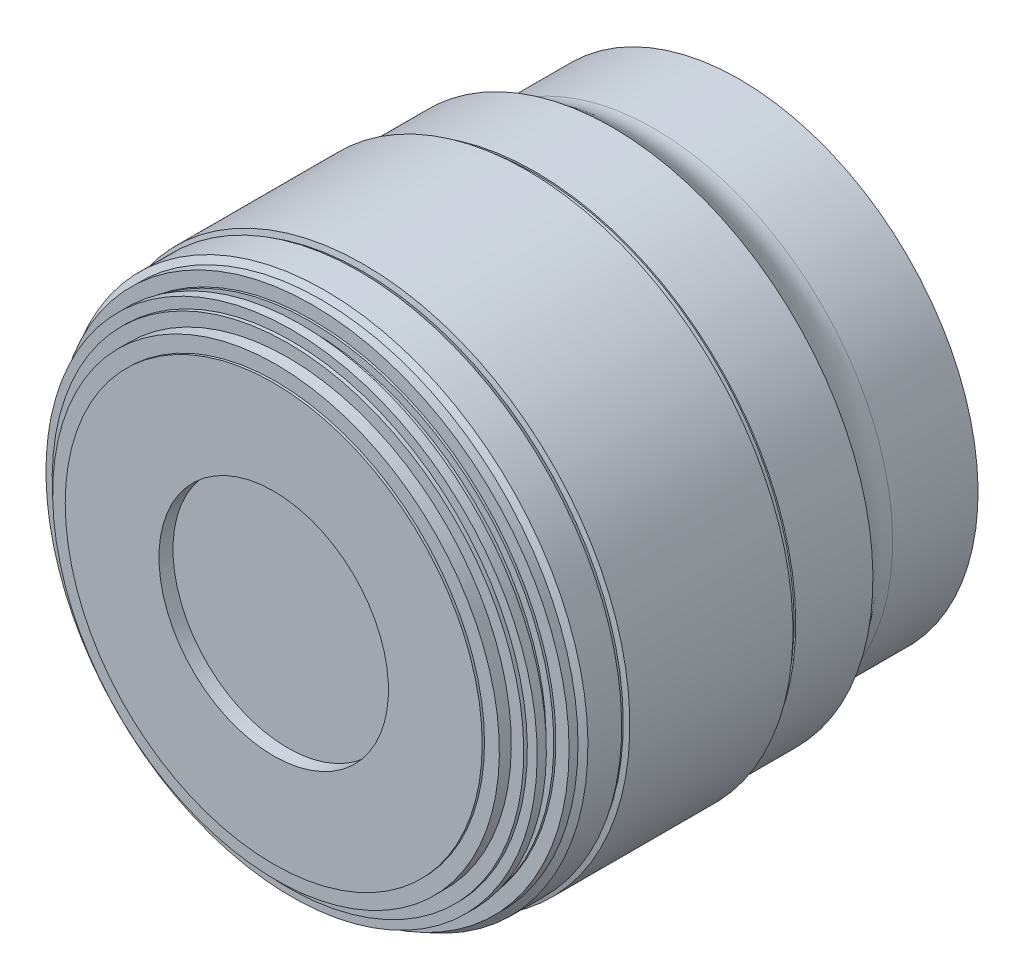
ISO-10303-21;
HEADER;
FILE_DESCRIPTION(('STEP AP214'),'2;1');
FILE_NAME('part.step','',(''),(''),'','','');
FILE_SCHEMA(('AUTOMOTIVE_DESIGN { 1 0 10303 214 1 1 1 1 }'));
ENDSEC;
DATA;
#1=APPLICATION_CONTEXT('core data for automotive mechanical design processes');
#2=APPLICATION_PROTOCOL_DEFINITION('international standard','automotive_design',2000,#1);
#3=PRODUCT_CONTEXT('',#1,'mechanical');
#4=PRODUCT('Part','Part','',(#3));
#5=PRODUCT_RELATED_PRODUCT_CATEGORY('part','',(#4));
#6=PRODUCT_DEFINITION_FORMATION('','',#4);
#7=PRODUCT_DEFINITION_CONTEXT('part definition',#1,'design');
#8=PRODUCT_DEFINITION('design','',#6,#7);
#9=PRODUCT_DEFINITION_SHAPE('','',#8);
#10=(LENGTH_UNIT() NAMED_UNIT(*) SI_UNIT(.MILLI.,.METRE.));
#11=(NAMED_UNIT(*) PLANE_ANGLE_UNIT() SI_UNIT($,.RADIAN.));
#12=(NAMED_UNIT(*) SI_UNIT($,.STERADIAN.) SOLID_ANGLE_UNIT());
#13=UNCERTAINTY_MEASURE_WITH_UNIT(LENGTH_MEASURE(1.E-05),#10,'distance_accuracy_value','');
#14=(GEOMETRIC_REPRESENTATION_CONTEXT(3) GLOBAL_UNCERTAINTY_ASSIGNED_CONTEXT((#13)) GLOBAL_UNIT_ASSIGNED_CONTEXT((#10,
#11,#12)) REPRESENTATION_CONTEXT('',''));
#15=CARTESIAN_POINT('',(0.,0.,0.));
#16=DIRECTION('',(0.,0.,1.));
#17=DIRECTION('',(1.,0.,0.));
#18=AXIS2_PLACEMENT_3D('',#15,#16,#17);
#19=CARTESIAN_POINT('',(0.,22.5666826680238,0.));
#20=DIRECTION('',(0.,0.,-1.));
#21=DIRECTION('',(0.,1.,0.));
#22=AXIS2_PLACEMENT_3D('',#19,#20,#21);
#23=PLANE('',#22);
#24=CARTESIAN_POINT('',(0.,0.,0.));
#25=DIRECTION('',(0.,0.,-1.));
#26=DIRECTION('',(0.,1.,0.));
#27=AXIS2_PLACEMENT_3D('',#24,#25,#26);
#28=CIRCLE('',#27,22.5666826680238);
#29=CARTESIAN_POINT('',(0.,22.5666826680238,0.));
#30=VERTEX_POINT('',#29);
#31=EDGE_CURVE('E12',#30,#30,#28,.T.);
#32=ORIENTED_EDGE('',*,*,#31,.T.);
#33=EDGE_LOOP('',(#32));
#34=FACE_BOUND('',#33,.T.);
#35=ADVANCED_FACE('F53',(#34),#23,.T.);
#36=CARTESIAN_POINT('',(0.,0.,0.));
#37=DIRECTION('',(0.,0.,-1.));
#38=DIRECTION('',(0.,1.,0.));
#39=AXIS2_PLACEMENT_3D('',#36,#37,#38);
#40=CYLINDRICAL_SURFACE('',#39,22.5666826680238);
#41=CARTESIAN_POINT('',(0.,0.,0.31721651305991));
#42=DIRECTION('',(0.,0.,-1.));
#43=DIRECTION('',(0.,1.,0.));
#44=AXIS2_PLACEMENT_3D('',#41,#42,#43);
#45=CIRCLE('',#44,22.5666826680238);
#46=CARTESIAN_POINT('',(0.,22.5666826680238,0.317216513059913));
#47=VERTEX_POINT('',#46);
#48=EDGE_CURVE('E60',#47,#47,#45,.T.);
#49=ORIENTED_EDGE('',*,*,#48,.T.);
#50=EDGE_LOOP('',(#49));
#51=FACE_BOUND('',#50,.T.);
#52=ORIENTED_EDGE('',*,*,#31,.F.);
#53=EDGE_LOOP('',(#52));
#54=FACE_BOUND('',#53,.T.);
#55=ADVANCED_FACE('F81',(#51,#54),#40,.T.);
#56=CARTESIAN_POINT('',(0.,22.5666826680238,0.317216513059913));
#57=DIRECTION('',(0.,0.,1.));
#58=DIRECTION('',(0.,-1.,0.));
#59=AXIS2_PLACEMENT_3D('',#56,#57,#58);
#60=PLANE('',#59);
#61=CARTESIAN_POINT('',(0.,0.,0.31721651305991));
#62=DIRECTION('',(0.,0.,-1.));
#63=DIRECTION('',(0.,1.,0.));
#64=AXIS2_PLACEMENT_3D('',#61,#62,#63);
#65=CIRCLE('',#64,22.3985393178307);
#66=CARTESIAN_POINT('',(0.,22.3985393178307,0.317216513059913));
#67=VERTEX_POINT('',#66);
#68=EDGE_CURVE('E231',#67,#67,#65,.T.);
#69=ORIENTED_EDGE('',*,*,#68,.T.);
#70=EDGE_LOOP('',(#69));
#71=FACE_BOUND('',#70,.T.);
#72=ORIENTED_EDGE('',*,*,#48,.F.);
#73=EDGE_LOOP('',(#72));
#74=FACE_BOUND('',#73,.T.);
#75=ADVANCED_FACE('F86',(#71,#74),#60,.T.);
#76=CARTESIAN_POINT('',(0.,0.,0.));
#77=DIRECTION('',(0.,0.,-1.));
#78=DIRECTION('',(0.,1.,0.));
#79=AXIS2_PLACEMENT_3D('',#76,#77,#78);
#80=CYLINDRICAL_SURFACE('',#79,22.3985393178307);
#81=CARTESIAN_POINT('',(0.,0.,1.66055023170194));
#82=DIRECTION('',(0.,0.,-1.));
#83=DIRECTION('',(0.,1.,0.));
#84=AXIS2_PLACEMENT_3D('',#81,#82,#83);
#85=CIRCLE('',#84,22.3985393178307);
#86=CARTESIAN_POINT('',(0.,22.3985393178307,1.66055023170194));
#87=VERTEX_POINT('',#86);
#88=EDGE_CURVE('E228',#87,#87,#85,.T.);
#89=ORIENTED_EDGE('',*,*,#88,.T.);
#90=EDGE_LOOP('',(#89));
#91=FACE_BOUND('',#90,.T.);
#92=ORIENTED_EDGE('',*,*,#68,.F.);
#93=EDGE_LOOP('',(#92));
#94=FACE_BOUND('',#93,.T.);
#95=ADVANCED_FACE('F93',(#91,#94),#80,.T.);
#96=CARTESIAN_POINT('',(0.,22.3985393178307,1.66055023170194));
#97=DIRECTION('',(0.,0.,-1.));
#98=DIRECTION('',(0.,1.,0.));
#99=AXIS2_PLACEMENT_3D('',#96,#97,#98);
#100=PLANE('',#99);
#101=CARTESIAN_POINT('',(0.,0.,1.66055023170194));
#102=DIRECTION('',(0.,0.,-1.));
#103=DIRECTION('',(0.,1.,0.));
#104=AXIS2_PLACEMENT_3D('',#101,#102,#103);
#105=CIRCLE('',#104,23.9827601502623);
#106=CARTESIAN_POINT('',(0.,23.9827601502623,1.66055023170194));
#107=VERTEX_POINT('',#106);
#108=EDGE_CURVE('E225',#107,#107,#105,.T.);
#109=ORIENTED_EDGE('',*,*,#108,.T.);
#110=EDGE_LOOP('',(#109));
#111=FACE_BOUND('',#110,.T.);
#112=ORIENTED_EDGE('',*,*,#88,.F.);
#113=EDGE_LOOP('',(#112));
#114=FACE_BOUND('',#113,.T.);
#115=ADVANCED_FACE('F100',(#111,#114),#100,.T.);
#116=CARTESIAN_POINT('',(0.,0.,0.));
#117=DIRECTION('',(0.,0.,-1.));
#118=DIRECTION('',(0.,1.,0.));
#119=AXIS2_PLACEMENT_3D('',#116,#117,#118);
#120=CYLINDRICAL_SURFACE('',#119,23.9827601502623);
#121=CARTESIAN_POINT('',(0.,0.,2.78672208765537));
#122=DIRECTION('',(0.,0.,-1.));
#123=DIRECTION('',(0.,1.,0.));
#124=AXIS2_PLACEMENT_3D('',#121,#122,#123);
#125=CIRCLE('',#124,23.9827601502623);
#126=CARTESIAN_POINT('',(0.,23.9827601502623,2.78672208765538));
#127=VERTEX_POINT('',#126);
#128=EDGE_CURVE('E222',#127,#127,#125,.T.);
#129=ORIENTED_EDGE('',*,*,#128,.T.);
#130=EDGE_LOOP('',(#129));
#131=FACE_BOUND('',#130,.T.);
#132=ORIENTED_EDGE('',*,*,#108,.F.);
#133=EDGE_LOOP('',(#132));
#134=FACE_BOUND('',#133,.T.);
#135=ADVANCED_FACE('F104',(#131,#134),#120,.T.);
#136=CARTESIAN_POINT('',(0.,23.9827601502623,2.78672208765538));
#137=DIRECTION('',(0.,0.,-1.));
#138=DIRECTION('',(0.,1.,0.));
#139=AXIS2_PLACEMENT_3D('',#136,#137,#138);
#140=PLANE('',#139);
#141=CARTESIAN_POINT('',(0.,0.,2.78672208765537));
#142=DIRECTION('',(0.,0.,-1.));
#143=DIRECTION('',(0.,1.,0.));
#144=AXIS2_PLACEMENT_3D('',#141,#142,#143);
#145=CIRCLE('',#144,29.2701819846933);
#146=CARTESIAN_POINT('',(0.,29.2701819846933,2.78672208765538));
#147=VERTEX_POINT('',#146);
#148=EDGE_CURVE('E219',#147,#147,#145,.T.);
#149=ORIENTED_EDGE('',*,*,#148,.T.);
#150=EDGE_LOOP('',(#149));
#151=FACE_BOUND('',#150,.T.);
#152=ORIENTED_EDGE('',*,*,#128,.F.);
#153=EDGE_LOOP('',(#152));
#154=FACE_BOUND('',#153,.T.);
#155=ADVANCED_FACE('F108',(#151,#154),#140,.T.);
#156=CARTESIAN_POINT('',(0.,0.,0.));
#157=DIRECTION('',(0.,0.,-1.));
#158=DIRECTION('',(0.,1.,0.));
#159=AXIS2_PLACEMENT_3D('',#156,#157,#158);
#160=CYLINDRICAL_SURFACE('',#159,29.2701819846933);
#161=CARTESIAN_POINT('',(0.,0.,3.06095479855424));
#162=DIRECTION('',(0.,0.,-1.));
#163=DIRECTION('',(0.,1.,0.));
#164=AXIS2_PLACEMENT_3D('',#161,#162,#163);
#165=CIRCLE('',#164,29.2701819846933);
#166=CARTESIAN_POINT('',(0.,29.2701819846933,3.06095479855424));
#167=VERTEX_POINT('',#166);
#168=EDGE_CURVE('E216',#167,#167,#165,.T.);
#169=ORIENTED_EDGE('',*,*,#168,.T.);
#170=EDGE_LOOP('',(#169));
#171=FACE_BOUND('',#170,.T.);
#172=ORIENTED_EDGE('',*,*,#148,.F.);
#173=EDGE_LOOP('',(#172));
#174=FACE_BOUND('',#173,.T.);
#175=ADVANCED_FACE('F112',(#171,#174),#160,.T.);
#176=CARTESIAN_POINT('',(0.,29.2701819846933,3.06095479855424));
#177=DIRECTION('',(0.,0.,-1.));
#178=DIRECTION('',(0.,1.,0.));
#179=AXIS2_PLACEMENT_3D('',#176,#177,#178);
#180=PLANE('',#179);
#181=CARTESIAN_POINT('',(0.,0.,3.06095479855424));
#182=DIRECTION('',(0.,0.,-1.));
#183=DIRECTION('',(0.,1.,0.));
#184=AXIS2_PLACEMENT_3D('',#181,#182,#183);
#185=CIRCLE('',#184,30.7);
#186=CARTESIAN_POINT('',(0.,30.7,3.06095479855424));
#187=VERTEX_POINT('',#186);
#188=EDGE_CURVE('E213',#187,#187,#185,.T.);
#189=ORIENTED_EDGE('',*,*,#188,.T.);
#190=EDGE_LOOP('',(#189));
#191=FACE_BOUND('',#190,.T.);
#192=ORIENTED_EDGE('',*,*,#168,.F.);
#193=EDGE_LOOP('',(#192));
#194=FACE_BOUND('',#193,.T.);
#195=ADVANCED_FACE('F116',(#191,#194),#180,.T.);
#196=CARTESIAN_POINT('',(0.,0.,0.));
#197=DIRECTION('',(0.,0.,-1.));
#198=DIRECTION('',(0.,1.,0.));
#199=AXIS2_PLACEMENT_3D('',#196,#197,#198);
#200=CYLINDRICAL_SURFACE('',#199,30.7);
#201=CARTESIAN_POINT('',(0.,0.,14.0609547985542));
#202=DIRECTION('',(0.,0.,-1.));
#203=DIRECTION('',(0.,1.,0.));
#204=AXIS2_PLACEMENT_3D('',#201,#202,#203);
#205=CIRCLE('',#204,30.7);
#206=CARTESIAN_POINT('',(0.,30.7,14.0609547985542));
#207=VERTEX_POINT('',#206);
#208=EDGE_CURVE('E210',#207,#207,#205,.T.);
#209=ORIENTED_EDGE('',*,*,#208,.T.);
#210=EDGE_LOOP('',(#209));
#211=FACE_BOUND('',#210,.T.);
#212=ORIENTED_EDGE('',*,*,#188,.F.);
#213=EDGE_LOOP('',(#212));
#214=FACE_BOUND('',#213,.T.);
#215=ADVANCED_FACE('F120',(#211,#214),#200,.T.);
#216=CARTESIAN_POINT('',(0.,30.7,14.0609547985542));
#217=CARTESIAN_POINT('',(0.,30.7,16.4988069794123));
#218=CARTESIAN_POINT('',(0.,32.3073486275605,17.7825013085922));
#219=CARTESIAN_POINT('',(0.,33.55,19.4478462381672));
#220=B_SPLINE_CURVE_WITH_KNOTS('',3,(#216,#217,#218,#219),.UNSPECIFIED.,.F.,.F.,(4,4),(0.,1.),.UNSPECIFIED.);
#221=CARTESIAN_POINT('',(0.,0.,0.));
#222=DIRECTION('',(0.,0.,-1.));
#223=AXIS1_PLACEMENT('',#221,#222);
#224=SURFACE_OF_REVOLUTION('',#220,#223);
#225=CARTESIAN_POINT('',(0.,0.,19.4478462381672));
#226=DIRECTION('',(0.,0.,-1.));
#227=DIRECTION('',(0.,1.,0.));
#228=AXIS2_PLACEMENT_3D('',#225,#226,#227);
#229=CIRCLE('',#228,33.55);
#230=CARTESIAN_POINT('',(0.,33.55,19.4478462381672));
#231=VERTEX_POINT('',#230);
#232=EDGE_CURVE('E207',#231,#231,#229,.T.);
#233=ORIENTED_EDGE('',*,*,#232,.T.);
#234=EDGE_LOOP('',(#233));
#235=FACE_BOUND('',#234,.T.);
#236=ORIENTED_EDGE('',*,*,#208,.F.);
#237=EDGE_LOOP('',(#236));
#238=FACE_BOUND('',#237,.T.);
#239=ADVANCED_FACE('F124',(#235,#238),#224,.F.);
#240=CARTESIAN_POINT('',(0.,0.,0.));
#241=DIRECTION('',(0.,0.,-1.));
#242=DIRECTION('',(0.,1.,0.));
#243=AXIS2_PLACEMENT_3D('',#240,#241,#242);
#244=CYLINDRICAL_SURFACE('',#243,33.55);
#245=CARTESIAN_POINT('',(0.,0.,29.3850400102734));
#246=DIRECTION('',(0.,0.,-1.));
#247=DIRECTION('',(0.,1.,0.));
#248=AXIS2_PLACEMENT_3D('',#245,#246,#247);
#249=CIRCLE('',#248,33.55);
#250=CARTESIAN_POINT('',(0.,33.55,29.3850400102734));
#251=VERTEX_POINT('',#250);
#252=EDGE_CURVE('E204',#251,#251,#249,.T.);
#253=ORIENTED_EDGE('',*,*,#252,.T.);
#254=EDGE_LOOP('',(#253));
#255=FACE_BOUND('',#254,.T.);
#256=ORIENTED_EDGE('',*,*,#232,.F.);
#257=EDGE_LOOP('',(#256));
#258=FACE_BOUND('',#257,.T.);
#259=ADVANCED_FACE('F129',(#255,#258),#244,.T.);
#260=CARTESIAN_POINT('',(0.,33.55,29.3850400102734));
#261=DIRECTION('',(0.,0.,1.));
#262=DIRECTION('',(0.,-1.,0.));
#263=AXIS2_PLACEMENT_3D('',#260,#261,#262);
#264=PLANE('',#263);
#265=CARTESIAN_POINT('',(0.,0.,29.3850400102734));
#266=DIRECTION('',(0.,0.,-1.));
#267=DIRECTION('',(0.,1.,0.));
#268=AXIS2_PLACEMENT_3D('',#265,#266,#267);
#269=CIRCLE('',#268,33.3422035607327);
#270=CARTESIAN_POINT('',(0.,33.3422035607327,29.3850400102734));
#271=VERTEX_POINT('',#270);
#272=EDGE_CURVE('E201',#271,#271,#269,.T.);
#273=ORIENTED_EDGE('',*,*,#272,.T.);
#274=EDGE_LOOP('',(#273));
#275=FACE_BOUND('',#274,.T.);
#276=ORIENTED_EDGE('',*,*,#252,.F.);
#277=EDGE_LOOP('',(#276));
#278=FACE_BOUND('',#277,.T.);
#279=ADVANCED_FACE('F255',(#275,#278),#264,.T.);
#280=CARTESIAN_POINT('',(0.,0.,0.));
#281=DIRECTION('',(0.,0.,-1.));
#282=DIRECTION('',(0.,1.,0.));
#283=AXIS2_PLACEMENT_3D('',#280,#281,#282);
#284=CYLINDRICAL_SURFACE('',#283,33.3422035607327);
#285=CARTESIAN_POINT('',(0.,0.,29.857058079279));
#286=DIRECTION('',(0.,0.,-1.));
#287=DIRECTION('',(0.,1.,0.));
#288=AXIS2_PLACEMENT_3D('',#285,#286,#287);
#289=CIRCLE('',#288,33.3422035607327);
#290=CARTESIAN_POINT('',(0.,33.3422035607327,29.857058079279));
#291=VERTEX_POINT('',#290);
#292=EDGE_CURVE('E198',#291,#291,#289,.T.);
#293=ORIENTED_EDGE('',*,*,#292,.T.);
#294=EDGE_LOOP('',(#293));
#295=FACE_BOUND('',#294,.T.);
#296=ORIENTED_EDGE('',*,*,#272,.F.);
#297=EDGE_LOOP('',(#296));
#298=FACE_BOUND('',#297,.T.);
#299=ADVANCED_FACE('F260',(#295,#298),#284,.T.);
#300=CARTESIAN_POINT('',(0.,0.,29.857058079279));
#301=DIRECTION('',(0.,0.,1.));
#302=DIRECTION('',(0.,-1.,0.));
#303=AXIS2_PLACEMENT_3D('',#300,#301,#302);
#304=CONICAL_SURFACE('',#303,33.3422035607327,0.993863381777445);
#305=CARTESIAN_POINT('',(0.,0.,30.4478462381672));
#306=DIRECTION('',(0.,0.,-1.));
#307=DIRECTION('',(0.,1.,0.));
#308=AXIS2_PLACEMENT_3D('',#305,#306,#307);
#309=CIRCLE('',#308,34.25);
#310=CARTESIAN_POINT('',(0.,34.25,30.4478462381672));
#311=VERTEX_POINT('',#310);
#312=EDGE_CURVE('E195',#311,#311,#309,.T.);
#313=ORIENTED_EDGE('',*,*,#312,.T.);
#314=EDGE_LOOP('',(#313));
#315=FACE_BOUND('',#314,.T.);
#316=ORIENTED_EDGE('',*,*,#292,.F.);
#317=EDGE_LOOP('',(#316));
#318=FACE_BOUND('',#317,.T.);
#319=ADVANCED_FACE('F267',(#315,#318),#304,.T.);
#320=CARTESIAN_POINT('',(0.,0.,0.));
#321=DIRECTION('',(0.,0.,-1.));
#322=DIRECTION('',(0.,1.,0.));
#323=AXIS2_PLACEMENT_3D('',#320,#321,#322);
#324=CYLINDRICAL_SURFACE('',#323,34.25);
#325=CARTESIAN_POINT('',(0.,0.,51.4478462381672));
#326=DIRECTION('',(0.,0.,-1.));
#327=DIRECTION('',(0.,1.,0.));
#328=AXIS2_PLACEMENT_3D('',#325,#326,#327);
#329=CIRCLE('',#328,34.25);
#330=CARTESIAN_POINT('',(0.,34.25,51.4478462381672));
#331=VERTEX_POINT('',#330);
#332=EDGE_CURVE('E192',#331,#331,#329,.T.);
#333=ORIENTED_EDGE('',*,*,#332,.T.);
#334=EDGE_LOOP('',(#333));
#335=FACE_BOUND('',#334,.T.);
#336=ORIENTED_EDGE('',*,*,#312,.F.);
#337=EDGE_LOOP('',(#336));
#338=FACE_BOUND('',#337,.T.);
#339=ADVANCED_FACE('F273',(#335,#338),#324,.T.);
#340=CARTESIAN_POINT('',(0.,0.,51.4478462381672));
#341=DIRECTION('',(0.,0.,-1.));
#342=DIRECTION('',(0.,1.,0.));
#343=AXIS2_PLACEMENT_3D('',#340,#341,#342);
#344=CONICAL_SURFACE('',#343,34.25,1.357788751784);
#345=CARTESIAN_POINT('',(0.,0.,51.5992483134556));
#346=DIRECTION('',(0.,0.,-1.));
#347=DIRECTION('',(0.,1.,0.));
#348=AXIS2_PLACEMENT_3D('',#345,#346,#347);
#349=CIRCLE('',#348,33.55);
#350=CARTESIAN_POINT('',(0.,33.55,51.5992483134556));
#351=VERTEX_POINT('',#350);
#352=EDGE_CURVE('E189',#351,#351,#349,.T.);
#353=ORIENTED_EDGE('',*,*,#352,.T.);
#354=EDGE_LOOP('',(#353));
#355=FACE_BOUND('',#354,.T.);
#356=ORIENTED_EDGE('',*,*,#332,.F.);
#357=EDGE_LOOP('',(#356));
#358=FACE_BOUND('',#357,.T.);
#359=ADVANCED_FACE('F277',(#355,#358),#344,.T.);
#360=CARTESIAN_POINT('',(0.,0.,51.5992483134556));
#361=DIRECTION('',(0.,0.,1.));
#362=DIRECTION('',(0.,-1.,0.));
#363=AXIS2_PLACEMENT_3D('',#360,#361,#362);
#364=CONICAL_SURFACE('',#363,33.55,0.537902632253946);
#365=CARTESIAN_POINT('',(0.,0.,52.1021127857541));
#366=DIRECTION('',(0.,0.,-1.));
#367=DIRECTION('',(0.,1.,0.));
#368=AXIS2_PLACEMENT_3D('',#365,#366,#367);
#369=CIRCLE('',#368,33.85);
#370=CARTESIAN_POINT('',(0.,33.85,52.1021127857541));
#371=VERTEX_POINT('',#370);
#372=EDGE_CURVE('E186',#371,#371,#369,.T.);
#373=ORIENTED_EDGE('',*,*,#372,.T.);
#374=EDGE_LOOP('',(#373));
#375=FACE_BOUND('',#374,.T.);
#376=ORIENTED_EDGE('',*,*,#352,.F.);
#377=EDGE_LOOP('',(#376));
#378=FACE_BOUND('',#377,.T.);
#379=ADVANCED_FACE('F281',(#375,#378),#364,.T.);
#380=CARTESIAN_POINT('',(0.,0.,0.));
#381=DIRECTION('',(0.,0.,-1.));
#382=DIRECTION('',(0.,1.,0.));
#383=AXIS2_PLACEMENT_3D('',#380,#381,#382);
#384=CYLINDRICAL_SURFACE('',#383,33.85);
#385=CARTESIAN_POINT('',(0.,0.,56.4478462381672));
#386=DIRECTION('',(0.,0.,-1.));
#387=DIRECTION('',(0.,1.,0.));
#388=AXIS2_PLACEMENT_3D('',#385,#386,#387);
#389=CIRCLE('',#388,33.85);
#390=CARTESIAN_POINT('',(0.,33.85,56.4478462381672));
#391=VERTEX_POINT('',#390);
#392=EDGE_CURVE('E183',#391,#391,#389,.T.);
#393=ORIENTED_EDGE('',*,*,#392,.T.);
#394=EDGE_LOOP('',(#393));
#395=FACE_BOUND('',#394,.T.);
#396=ORIENTED_EDGE('',*,*,#372,.F.);
#397=EDGE_LOOP('',(#396));
#398=FACE_BOUND('',#397,.T.);
#399=ADVANCED_FACE('F285',(#395,#398),#384,.T.);
#400=CARTESIAN_POINT('',(0.,0.,56.4478462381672));
#401=DIRECTION('',(0.,0.,-1.));
#402=DIRECTION('',(0.,1.,0.));
#403=AXIS2_PLACEMENT_3D('',#400,#401,#402);
#404=CONICAL_SURFACE('',#403,33.85,1.03289369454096);
#405=CARTESIAN_POINT('',(0.,0.,56.9247464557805));
#406=DIRECTION('',(0.,0.,-1.));
#407=DIRECTION('',(0.,1.,0.));
#408=AXIS2_PLACEMENT_3D('',#405,#406,#407);
#409=CIRCLE('',#408,33.0506127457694);
#410=CARTESIAN_POINT('',(0.,33.0506127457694,56.9247464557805));
#411=VERTEX_POINT('',#410);
#412=EDGE_CURVE('E180',#411,#411,#409,.T.);
#413=ORIENTED_EDGE('',*,*,#412,.T.);
#414=EDGE_LOOP('',(#413));
#415=FACE_BOUND('',#414,.T.);
#416=ORIENTED_EDGE('',*,*,#392,.F.);
#417=EDGE_LOOP('',(#416));
#418=FACE_BOUND('',#417,.T.);
#419=ADVANCED_FACE('F289',(#415,#418),#404,.T.);
#420=CARTESIAN_POINT('',(0.,0.,0.));
#421=DIRECTION('',(0.,0.,-1.));
#422=DIRECTION('',(0.,1.,0.));
#423=AXIS2_PLACEMENT_3D('',#420,#421,#422);
#424=CYLINDRICAL_SURFACE('',#423,33.0506127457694);
#425=CARTESIAN_POINT('',(0.,0.,58.0757176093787));
#426=DIRECTION('',(0.,0.,-1.));
#427=DIRECTION('',(0.,1.,0.));
#428=AXIS2_PLACEMENT_3D('',#425,#426,#427);
#429=CIRCLE('',#428,33.0506127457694);
#430=CARTESIAN_POINT('',(0.,33.0506127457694,58.0757176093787));
#431=VERTEX_POINT('',#430);
#432=EDGE_CURVE('E177',#431,#431,#429,.T.);
#433=ORIENTED_EDGE('',*,*,#432,.T.);
#434=EDGE_LOOP('',(#433));
#435=FACE_BOUND('',#434,.T.);
#436=ORIENTED_EDGE('',*,*,#412,.F.);
#437=EDGE_LOOP('',(#436));
#438=FACE_BOUND('',#437,.T.);
#439=ADVANCED_FACE('F293',(#435,#438),#424,.T.);
#440=CARTESIAN_POINT('',(0.,33.0506127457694,58.0757176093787));
#441=DIRECTION('',(0.,0.,1.));
#442=DIRECTION('',(0.,-1.,0.));
#443=AXIS2_PLACEMENT_3D('',#440,#441,#442);
#444=PLANE('',#443);
#445=CARTESIAN_POINT('',(0.,0.,58.0757176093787));
#446=DIRECTION('',(0.,0.,-1.));
#447=DIRECTION('',(0.,1.,0.));
#448=AXIS2_PLACEMENT_3D('',#445,#446,#447);
#449=CIRCLE('',#448,31.3540227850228);
#450=CARTESIAN_POINT('',(0.,31.3540227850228,58.0757176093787));
#451=VERTEX_POINT('',#450);
#452=EDGE_CURVE('E174',#451,#451,#449,.T.);
#453=ORIENTED_EDGE('',*,*,#452,.T.);
#454=EDGE_LOOP('',(#453));
#455=FACE_BOUND('',#454,.T.);
#456=ORIENTED_EDGE('',*,*,#432,.F.);
#457=EDGE_LOOP('',(#456));
#458=FACE_BOUND('',#457,.T.);
#459=ADVANCED_FACE('F297',(#455,#458),#444,.T.);
#460=CARTESIAN_POINT('',(0.,0.,0.));
#461=DIRECTION('',(0.,0.,-1.));
#462=DIRECTION('',(0.,1.,0.));
#463=AXIS2_PLACEMENT_3D('',#460,#461,#462);
#464=CYLINDRICAL_SURFACE('',#463,31.3540227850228);
#465=CARTESIAN_POINT('',(0.,0.,58.3510421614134));
#466=DIRECTION('',(0.,0.,-1.));
#467=DIRECTION('',(0.,1.,0.));
#468=AXIS2_PLACEMENT_3D('',#465,#466,#467);
#469=CIRCLE('',#468,31.3540227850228);
#470=CARTESIAN_POINT('',(0.,31.3540227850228,58.3510421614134));
#471=VERTEX_POINT('',#470);
#472=EDGE_CURVE('E171',#471,#471,#469,.T.);
#473=ORIENTED_EDGE('',*,*,#472,.T.);
#474=EDGE_LOOP('',(#473));
#475=FACE_BOUND('',#474,.T.);
#476=ORIENTED_EDGE('',*,*,#452,.F.);
#477=EDGE_LOOP('',(#476));
#478=FACE_BOUND('',#477,.T.);
#479=ADVANCED_FACE('F301',(#475,#478),#464,.T.);
#480=CARTESIAN_POINT('',(0.,31.3540227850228,58.3510421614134));
#481=DIRECTION('',(0.,0.,1.));
#482=DIRECTION('',(0.,-1.,0.));
#483=AXIS2_PLACEMENT_3D('',#480,#481,#482);
#484=PLANE('',#483);
#485=CARTESIAN_POINT('',(0.,0.,58.3510421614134));
#486=DIRECTION('',(0.,0.,-1.));
#487=DIRECTION('',(0.,1.,0.));
#488=AXIS2_PLACEMENT_3D('',#485,#486,#487);
#489=CIRCLE('',#488,30.3637042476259);
#490=CARTESIAN_POINT('',(0.,30.3637042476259,58.3510421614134));
#491=VERTEX_POINT('',#490);
#492=EDGE_CURVE('E168',#491,#491,#489,.T.);
#493=ORIENTED_EDGE('',*,*,#492,.T.);
#494=EDGE_LOOP('',(#493));
#495=FACE_BOUND('',#494,.T.);
#496=ORIENTED_EDGE('',*,*,#472,.F.);
#497=EDGE_LOOP('',(#496));
#498=FACE_BOUND('',#497,.T.);
#499=ADVANCED_FACE('F305',(#495,#498),#484,.T.);
#500=CARTESIAN_POINT('',(0.,0.,0.));
#501=DIRECTION('',(0.,0.,-1.));
#502=DIRECTION('',(0.,1.,0.));
#503=AXIS2_PLACEMENT_3D('',#500,#501,#502);
#504=CYLINDRICAL_SURFACE('',#503,30.3637042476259);
#505=CARTESIAN_POINT('',(0.,0.,59.5751926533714));
#506=DIRECTION('',(0.,0.,-1.));
#507=DIRECTION('',(0.,1.,0.));
#508=AXIS2_PLACEMENT_3D('',#505,#506,#507);
#509=CIRCLE('',#508,30.3637042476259);
#510=CARTESIAN_POINT('',(0.,30.3637042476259,59.5751926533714));
#511=VERTEX_POINT('',#510);
#512=EDGE_CURVE('E165',#511,#511,#509,.T.);
#513=ORIENTED_EDGE('',*,*,#512,.T.);
#514=EDGE_LOOP('',(#513));
#515=FACE_BOUND('',#514,.T.);
#516=ORIENTED_EDGE('',*,*,#492,.F.);
#517=EDGE_LOOP('',(#516));
#518=FACE_BOUND('',#517,.T.);
#519=ADVANCED_FACE('F309',(#515,#518),#504,.T.);
#520=CARTESIAN_POINT('',(0.,30.3637042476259,59.5751926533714));
#521=DIRECTION('',(0.,0.,-1.));
#522=DIRECTION('',(0.,1.,0.));
#523=AXIS2_PLACEMENT_3D('',#520,#521,#522);
#524=PLANE('',#523);
#525=CARTESIAN_POINT('',(0.,0.,59.5751926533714));
#526=DIRECTION('',(0.,0.,-1.));
#527=DIRECTION('',(0.,1.,0.));
#528=AXIS2_PLACEMENT_3D('',#525,#526,#527);
#529=CIRCLE('',#528,31.6286537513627);
#530=CARTESIAN_POINT('',(0.,31.6286537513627,59.5751926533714));
#531=VERTEX_POINT('',#530);
#532=EDGE_CURVE('E162',#531,#531,#529,.T.);
#533=ORIENTED_EDGE('',*,*,#532,.T.);
#534=EDGE_LOOP('',(#533));
#535=FACE_BOUND('',#534,.T.);
#536=ORIENTED_EDGE('',*,*,#512,.F.);
#537=EDGE_LOOP('',(#536));
#538=FACE_BOUND('',#537,.T.);
#539=ADVANCED_FACE('F313',(#535,#538),#524,.T.);
#540=CARTESIAN_POINT('',(0.,0.,0.));
#541=DIRECTION('',(0.,0.,-1.));
#542=DIRECTION('',(0.,1.,0.));
#543=AXIS2_PLACEMENT_3D('',#540,#541,#542);
#544=CYLINDRICAL_SURFACE('',#543,31.6286537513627);
#545=CARTESIAN_POINT('',(0.,0.,60.7593114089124));
#546=DIRECTION('',(0.,0.,-1.));
#547=DIRECTION('',(0.,1.,0.));
#548=AXIS2_PLACEMENT_3D('',#545,#546,#547);
#549=CIRCLE('',#548,31.6286537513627);
#550=CARTESIAN_POINT('',(0.,31.6286537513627,60.7593114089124));
#551=VERTEX_POINT('',#550);
#552=EDGE_CURVE('E159',#551,#551,#549,.T.);
#553=ORIENTED_EDGE('',*,*,#552,.T.);
#554=EDGE_LOOP('',(#553));
#555=FACE_BOUND('',#554,.T.);
#556=ORIENTED_EDGE('',*,*,#532,.F.);
#557=EDGE_LOOP('',(#556));
#558=FACE_BOUND('',#557,.T.);
#559=ADVANCED_FACE('F317',(#555,#558),#544,.T.);
#560=CARTESIAN_POINT('',(0.,31.6286537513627,60.7593114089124));
#561=DIRECTION('',(0.,0.,1.));
#562=DIRECTION('',(0.,-1.,0.));
#563=AXIS2_PLACEMENT_3D('',#560,#561,#562);
#564=PLANE('',#563);
#565=CARTESIAN_POINT('',(0.,0.,60.7593114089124));
#566=DIRECTION('',(0.,0.,-1.));
#567=DIRECTION('',(0.,1.,0.));
#568=AXIS2_PLACEMENT_3D('',#565,#566,#567);
#569=CIRCLE('',#568,30.3637042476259);
#570=CARTESIAN_POINT('',(0.,30.3637042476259,60.7593114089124));
#571=VERTEX_POINT('',#570);
#572=EDGE_CURVE('E156',#571,#571,#569,.T.);
#573=ORIENTED_EDGE('',*,*,#572,.T.);
#574=EDGE_LOOP('',(#573));
#575=FACE_BOUND('',#574,.T.);
#576=ORIENTED_EDGE('',*,*,#552,.F.);
#577=EDGE_LOOP('',(#576));
#578=FACE_BOUND('',#577,.T.);
#579=ADVANCED_FACE('F321',(#575,#578),#564,.T.);
#580=CARTESIAN_POINT('',(0.,0.,0.));
#581=DIRECTION('',(0.,0.,-1.));
#582=DIRECTION('',(0.,1.,0.));
#583=AXIS2_PLACEMENT_3D('',#580,#581,#582);
#584=CYLINDRICAL_SURFACE('',#583,30.3637042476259);
#585=CARTESIAN_POINT('',(0.,0.,61.2246994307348));
#586=DIRECTION('',(0.,0.,-1.));
#587=DIRECTION('',(0.,1.,0.));
#588=AXIS2_PLACEMENT_3D('',#585,#586,#587);
#589=CIRCLE('',#588,30.3637042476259);
#590=CARTESIAN_POINT('',(0.,30.3637042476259,61.2246994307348));
#591=VERTEX_POINT('',#590);
#592=EDGE_CURVE('E153',#591,#591,#589,.T.);
#593=ORIENTED_EDGE('',*,*,#592,.T.);
#594=EDGE_LOOP('',(#593));
#595=FACE_BOUND('',#594,.T.);
#596=ORIENTED_EDGE('',*,*,#572,.F.);
#597=EDGE_LOOP('',(#596));
#598=FACE_BOUND('',#597,.T.);
#599=ADVANCED_FACE('F325',(#595,#598),#584,.T.);
#600=CARTESIAN_POINT('',(0.,30.3637042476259,61.2246994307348));
#601=DIRECTION('',(0.,0.,1.));
#602=DIRECTION('',(0.,-1.,0.));
#603=AXIS2_PLACEMENT_3D('',#600,#601,#602);
#604=PLANE('',#603);
#605=CARTESIAN_POINT('',(0.,0.,61.2246994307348));
#606=DIRECTION('',(0.,0.,-1.));
#607=DIRECTION('',(0.,1.,0.));
#608=AXIS2_PLACEMENT_3D('',#605,#606,#607);
#609=CIRCLE('',#608,28.7611958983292);
#610=CARTESIAN_POINT('',(0.,28.7611958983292,61.2246994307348));
#611=VERTEX_POINT('',#610);
#612=EDGE_CURVE('E150',#611,#611,#609,.T.);
#613=ORIENTED_EDGE('',*,*,#612,.T.);
#614=EDGE_LOOP('',(#613));
#615=FACE_BOUND('',#614,.T.);
#616=ORIENTED_EDGE('',*,*,#592,.F.);
#617=EDGE_LOOP('',(#616));
#618=FACE_BOUND('',#617,.T.);
#619=ADVANCED_FACE('F329',(#615,#618),#604,.T.);
#620=CARTESIAN_POINT('',(0.,0.,0.));
#621=DIRECTION('',(0.,0.,-1.));
#622=DIRECTION('',(0.,1.,0.));
#623=AXIS2_PLACEMENT_3D('',#620,#621,#622);
#624=CYLINDRICAL_SURFACE('',#623,28.7611958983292);
#625=CARTESIAN_POINT('',(0.,0.,62.7639175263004));
#626=DIRECTION('',(0.,0.,-1.));
#627=DIRECTION('',(0.,1.,0.));
#628=AXIS2_PLACEMENT_3D('',#625,#626,#627);
#629=CIRCLE('',#628,28.7611958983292);
#630=CARTESIAN_POINT('',(0.,28.7611958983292,62.7639175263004));
#631=VERTEX_POINT('',#630);
#632=EDGE_CURVE('E147',#631,#631,#629,.T.);
#633=ORIENTED_EDGE('',*,*,#632,.T.);
#634=EDGE_LOOP('',(#633));
#635=FACE_BOUND('',#634,.T.);
#636=ORIENTED_EDGE('',*,*,#612,.F.);
#637=EDGE_LOOP('',(#636));
#638=FACE_BOUND('',#637,.T.);
#639=ADVANCED_FACE('F333',(#635,#638),#624,.T.);
#640=CARTESIAN_POINT('',(0.,28.7611958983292,62.7639175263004));
#641=DIRECTION('',(0.,0.,1.));
#642=DIRECTION('',(0.,-1.,0.));
#643=AXIS2_PLACEMENT_3D('',#640,#641,#642);
#644=PLANE('',#643);
#645=CARTESIAN_POINT('',(0.,0.,62.7639175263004));
#646=DIRECTION('',(0.,0.,-1.));
#647=DIRECTION('',(0.,1.,0.));
#648=AXIS2_PLACEMENT_3D('',#645,#646,#647);
#649=CIRCLE('',#648,26.8462402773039);
#650=CARTESIAN_POINT('',(0.,26.8462402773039,62.7639175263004));
#651=VERTEX_POINT('',#650);
#652=EDGE_CURVE('E144',#651,#651,#649,.T.);
#653=ORIENTED_EDGE('',*,*,#652,.T.);
#654=EDGE_LOOP('',(#653));
#655=FACE_BOUND('',#654,.T.);
#656=ORIENTED_EDGE('',*,*,#632,.F.);
#657=EDGE_LOOP('',(#656));
#658=FACE_BOUND('',#657,.T.);
#659=ADVANCED_FACE('F337',(#655,#658),#644,.T.);
#660=CARTESIAN_POINT('',(0.,0.,0.));
#661=DIRECTION('',(0.,0.,-1.));
#662=DIRECTION('',(0.,1.,0.));
#663=AXIS2_PLACEMENT_3D('',#660,#661,#662);
#664=CYLINDRICAL_SURFACE('',#663,26.8462402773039);
#665=CARTESIAN_POINT('',(0.,0.,63.0609547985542));
#666=DIRECTION('',(0.,0.,-1.));
#667=DIRECTION('',(0.,1.,0.));
#668=AXIS2_PLACEMENT_3D('',#665,#666,#667);
#669=CIRCLE('',#668,26.8462402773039);
#670=CARTESIAN_POINT('',(0.,26.8462402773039,63.0609547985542));
#671=VERTEX_POINT('',#670);
#672=EDGE_CURVE('E138',#671,#671,#669,.T.);
#673=ORIENTED_EDGE('',*,*,#672,.T.);
#674=EDGE_LOOP('',(#673));
#675=FACE_BOUND('',#674,.T.);
#676=ORIENTED_EDGE('',*,*,#652,.F.);
#677=EDGE_LOOP('',(#676));
#678=FACE_BOUND('',#677,.T.);
#679=ADVANCED_FACE('F75',(#675,#678),#664,.T.);
#680=CARTESIAN_POINT('',(0.,26.8462402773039,63.0609547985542));
#681=DIRECTION('',(0.,0.,1.));
#682=DIRECTION('',(0.,-1.,0.));
#683=AXIS2_PLACEMENT_3D('',#680,#681,#682);
#684=PLANE('',#683);
#685=CARTESIAN_POINT('',(0.,0.,63.0609547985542));
#686=DIRECTION('',(0.,0.,1.));
#687=DIRECTION('',(0.,-1.,0.));
#688=AXIS2_PLACEMENT_3D('',#685,#686,#687);
#689=CIRCLE('',#688,14.7732605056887);
#690=CARTESIAN_POINT('',(0.,-14.7732605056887,63.0609547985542));
#691=VERTEX_POINT('',#690);
#692=EDGE_CURVE('E56',#691,#691,#689,.T.);
#693=ORIENTED_EDGE('',*,*,#692,.F.);
#694=EDGE_LOOP('',(#693));
#695=FACE_BOUND('',#694,.T.);
#696=ORIENTED_EDGE('',*,*,#672,.F.);
#697=EDGE_LOOP('',(#696));
#698=FACE_BOUND('',#697,.T.);
#699=ADVANCED_FACE('F66',(#695,#698),#684,.T.);
#700=CARTESIAN_POINT('',(0.,0.,54.0544666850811));
#701=CARTESIAN_POINT('',(0.,7.81802615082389,53.9832148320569));
#702=CARTESIAN_POINT('',(0.,14.7732605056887,50.1885028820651));
#703=B_SPLINE_CURVE_WITH_KNOTS('',2,(#700,#701,#702),.UNSPECIFIED.,.F.,.F.,(3,3),(0.,1.),.UNSPECIFIED.);
#704=CARTESIAN_POINT('',(0.,0.,54.0544666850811));
#705=DIRECTION('',(0.,0.,-1.));
#706=AXIS1_PLACEMENT('',#704,#705);
#707=SURFACE_OF_REVOLUTION('',#703,#706);
#708=CARTESIAN_POINT('',(0.,0.,50.1885028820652));
#709=DIRECTION('',(0.,0.,-1.));
#710=DIRECTION('',(0.,1.,0.));
#711=AXIS2_PLACEMENT_3D('',#708,#709,#710);
#712=CIRCLE('',#711,14.7732605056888);
#713=CARTESIAN_POINT('',(0.,14.7732605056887,50.1885028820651));
#714=VERTEX_POINT('',#713);
#715=EDGE_CURVE('E137',#714,#714,#712,.T.);
#716=ORIENTED_EDGE('',*,*,#715,.F.);
#717=EDGE_LOOP('',(#716));
#718=FACE_BOUND('',#717,.T.);
#719=CARTESIAN_POINT('',(0.,0.,54.0544666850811));
#720=VERTEX_POINT('',#719);
#721=VERTEX_LOOP('',#720);
#722=FACE_BOUND('',#721,.T.);
#723=ADVANCED_FACE('F63',(#718,#722),#707,.T.);
#724=CARTESIAN_POINT('',(0.,0.,54.0544666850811));
#725=DIRECTION('',(0.,0.,-1.));
#726=DIRECTION('',(0.,1.,0.));
#727=AXIS2_PLACEMENT_3D('',#724,#725,#726);
#728=CYLINDRICAL_SURFACE('',#727,14.7732605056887);
#729=ORIENTED_EDGE('',*,*,#692,.T.);
#730=EDGE_LOOP('',(#729));
#731=FACE_BOUND('',#730,.T.);
#732=ORIENTED_EDGE('',*,*,#715,.T.);
#733=EDGE_LOOP('',(#732));
#734=FACE_BOUND('',#733,.T.);
#735=ADVANCED_FACE('F65',(#731,#734),#728,.F.);
#736=CLOSED_SHELL('',(#35,#55,#75,#95,#115,#135,#155,#175,#195,#215,#239,#259,#279,#299,#319,
#339,#359,#379,#399,#419,#439,#459,#479,#499,#519,#539,#559,#579,#599,#619,#639,#659,#679,#699,
#723,#735));
#737=MANIFOLD_SOLID_BREP('B2',#736);
#738=CARTESIAN_POINT('',(0.,0.,0.));
#739=DIRECTION('',(0.,0.,-1.));
#740=DIRECTION('',(-1.,0.,0.));
#741=AXIS2_PLACEMENT_3D('',#738,#739,#740);
#742=PLANE('',#741);
#743=CARTESIAN_POINT('',(0.,0.,0.));
#744=DIRECTION('',(0.,0.,-1.));
#745=DIRECTION('',(-1.,0.,0.));
#746=AXIS2_PLACEMENT_3D('',#743,#744,#745);
#747=CIRCLE('',#746,20.181677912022);
#748=CARTESIAN_POINT('',(-20.181677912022,0.,0.));
#749=VERTEX_POINT('',#748);
#750=EDGE_CURVE('E52',#749,#749,#747,.T.);
#751=ORIENTED_EDGE('',*,*,#750,.T.);
#752=EDGE_LOOP('',(#751));
#753=FACE_BOUND('',#752,.T.);
#754=ADVANCED_FACE('F749',(#753),#742,.T.);
#755=CARTESIAN_POINT('',(0.,0.,0.));
#756=DIRECTION('',(0.,0.,-1.));
#757=DIRECTION('',(-1.,0.,0.));
#758=AXIS2_PLACEMENT_3D('',#755,#756,#757);
#759=CYLINDRICAL_SURFACE('',#758,20.181677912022);
#760=CARTESIAN_POINT('',(0.,0.,1.66060991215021));
#761=DIRECTION('',(0.,0.,-1.));
#762=DIRECTION('',(-1.,0.,0.));
#763=AXIS2_PLACEMENT_3D('',#760,#761,#762);
#764=CIRCLE('',#763,20.181677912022);
#765=CARTESIAN_POINT('',(-20.181677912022,0.,1.66060991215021));
#766=VERTEX_POINT('',#765);
#767=EDGE_CURVE('E755',#766,#766,#764,.T.);
#768=ORIENTED_EDGE('',*,*,#767,.T.);
#769=EDGE_LOOP('',(#768));
#770=FACE_BOUND('',#769,.T.);
#771=ORIENTED_EDGE('',*,*,#750,.F.);
#772=EDGE_LOOP('',(#771));
#773=FACE_BOUND('',#772,.T.);
#774=ADVANCED_FACE('F899',(#770,#773),#759,.T.);
#775=CARTESIAN_POINT('',(0.,20.181677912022,1.66060991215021));
#776=DIRECTION('',(0.,0.,1.));
#777=DIRECTION('',(1.,0.,0.));
#778=AXIS2_PLACEMENT_3D('',#775,#776,#777);
#779=PLANE('',#778);
#780=CARTESIAN_POINT('',(0.,0.,1.66060991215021));
#781=DIRECTION('',(0.,0.,-1.));
#782=DIRECTION('',(-1.,0.,0.));
#783=AXIS2_PLACEMENT_3D('',#780,#781,#782);
#784=CIRCLE('',#783,20.0255748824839);
#785=CARTESIAN_POINT('',(-20.0255748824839,0.,1.66060991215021));
#786=VERTEX_POINT('',#785);
#787=EDGE_CURVE('E759',#786,#786,#784,.T.);
#788=ORIENTED_EDGE('',*,*,#787,.T.);
#789=EDGE_LOOP('',(#788));
#790=FACE_BOUND('',#789,.T.);
#791=ORIENTED_EDGE('',*,*,#767,.F.);
#792=EDGE_LOOP('',(#791));
#793=FACE_BOUND('',#792,.T.);
#794=ADVANCED_FACE('F896',(#790,#793),#779,.T.);
#795=CARTESIAN_POINT('',(0.,0.,0.));
#796=DIRECTION('',(0.,0.,-1.));
#797=DIRECTION('',(-1.,0.,0.));
#798=AXIS2_PLACEMENT_3D('',#795,#796,#797);
#799=CYLINDRICAL_SURFACE('',#798,20.0255748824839);
#800=CARTESIAN_POINT('',(0.,0.,3.72339994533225));
#801=DIRECTION('',(0.,0.,-1.));
#802=DIRECTION('',(-1.,0.,0.));
#803=AXIS2_PLACEMENT_3D('',#800,#801,#802);
#804=CIRCLE('',#803,20.0255748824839);
#805=CARTESIAN_POINT('',(-20.0255748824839,0.,3.72339994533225));
#806=VERTEX_POINT('',#805);
#807=EDGE_CURVE('E763',#806,#806,#804,.T.);
#808=ORIENTED_EDGE('',*,*,#807,.T.);
#809=EDGE_LOOP('',(#808));
#810=FACE_BOUND('',#809,.T.);
#811=ORIENTED_EDGE('',*,*,#787,.F.);
#812=EDGE_LOOP('',(#811));
#813=FACE_BOUND('',#812,.T.);
#814=ADVANCED_FACE('F892',(#810,#813),#799,.T.);
#815=CARTESIAN_POINT('',(0.,20.0255748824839,3.72339994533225));
#816=DIRECTION('',(0.,0.,-1.));
#817=DIRECTION('',(-1.,0.,0.));
#818=AXIS2_PLACEMENT_3D('',#815,#816,#817);
#819=PLANE('',#818);
#820=CARTESIAN_POINT('',(0.,0.,3.72339994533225));
#821=DIRECTION('',(0.,0.,-1.));
#822=DIRECTION('',(-1.,0.,0.));
#823=AXIS2_PLACEMENT_3D('',#820,#821,#822);
#824=CIRCLE('',#823,21.5977553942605);
#825=CARTESIAN_POINT('',(-21.5977553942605,0.,3.72339994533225));
#826=VERTEX_POINT('',#825);
#827=EDGE_CURVE('E768',#826,#826,#824,.T.);
#828=ORIENTED_EDGE('',*,*,#827,.T.);
#829=EDGE_LOOP('',(#828));
#830=FACE_BOUND('',#829,.T.);
#831=ORIENTED_EDGE('',*,*,#807,.F.);
#832=EDGE_LOOP('',(#831));
#833=FACE_BOUND('',#832,.T.);
#834=ADVANCED_FACE('F888',(#830,#833),#819,.T.);
#835=CARTESIAN_POINT('',(0.,0.,0.));
#836=DIRECTION('',(0.,0.,-1.));
#837=DIRECTION('',(-1.,0.,0.));
#838=AXIS2_PLACEMENT_3D('',#835,#836,#837);
#839=CYLINDRICAL_SURFACE('',#838,21.5977553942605);
#840=CARTESIAN_POINT('',(0.,0.,4.84957180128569));
#841=DIRECTION('',(0.,0.,-1.));
#842=DIRECTION('',(-1.,0.,0.));
#843=AXIS2_PLACEMENT_3D('',#840,#841,#842);
#844=CIRCLE('',#843,21.5977553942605);
#845=CARTESIAN_POINT('',(-21.5977553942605,0.,4.84957180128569));
#846=VERTEX_POINT('',#845);
#847=EDGE_CURVE('E771',#846,#846,#844,.T.);
#848=ORIENTED_EDGE('',*,*,#847,.T.);
#849=EDGE_LOOP('',(#848));
#850=FACE_BOUND('',#849,.T.);
#851=ORIENTED_EDGE('',*,*,#827,.F.);
#852=EDGE_LOOP('',(#851));
#853=FACE_BOUND('',#852,.T.);
#854=ADVANCED_FACE('F884',(#850,#853),#839,.T.);
#855=CARTESIAN_POINT('',(0.,21.5977553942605,4.84957180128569));
#856=DIRECTION('',(0.,0.,-1.));
#857=DIRECTION('',(-1.,0.,0.));
#858=AXIS2_PLACEMENT_3D('',#855,#856,#857);
#859=PLANE('',#858);
#860=CARTESIAN_POINT('',(0.,0.,4.84957180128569));
#861=DIRECTION('',(0.,0.,-1.));
#862=DIRECTION('',(-1.,0.,0.));
#863=AXIS2_PLACEMENT_3D('',#860,#861,#862);
#864=CIRCLE('',#863,26.8851772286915);
#865=CARTESIAN_POINT('',(-26.8851772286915,0.,4.84957180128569));
#866=VERTEX_POINT('',#865);
#867=EDGE_CURVE('E774',#866,#866,#864,.T.);
#868=ORIENTED_EDGE('',*,*,#867,.T.);
#869=EDGE_LOOP('',(#868));
#870=FACE_BOUND('',#869,.T.);
#871=ORIENTED_EDGE('',*,*,#847,.F.);
#872=EDGE_LOOP('',(#871));
#873=FACE_BOUND('',#872,.T.);
#874=ADVANCED_FACE('F880',(#870,#873),#859,.T.);
#875=CARTESIAN_POINT('',(0.,0.,0.));
#876=DIRECTION('',(0.,0.,-1.));
#877=DIRECTION('',(-1.,0.,0.));
#878=AXIS2_PLACEMENT_3D('',#875,#876,#877);
#879=CYLINDRICAL_SURFACE('',#878,26.8851772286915);
#880=CARTESIAN_POINT('',(0.,0.,5.12380451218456));
#881=DIRECTION('',(0.,0.,-1.));
#882=DIRECTION('',(-1.,0.,0.));
#883=AXIS2_PLACEMENT_3D('',#880,#881,#882);
#884=CIRCLE('',#883,26.8851772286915);
#885=CARTESIAN_POINT('',(-26.8851772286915,0.,5.12380451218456));
#886=VERTEX_POINT('',#885);
#887=EDGE_CURVE('E777',#886,#886,#884,.T.);
#888=ORIENTED_EDGE('',*,*,#887,.T.);
#889=EDGE_LOOP('',(#888));
#890=FACE_BOUND('',#889,.T.);
#891=ORIENTED_EDGE('',*,*,#867,.F.);
#892=EDGE_LOOP('',(#891));
#893=FACE_BOUND('',#892,.T.);
#894=ADVANCED_FACE('F876',(#890,#893),#879,.T.);
#895=CARTESIAN_POINT('',(0.,26.8851772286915,5.12380451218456));
#896=DIRECTION('',(0.,0.,-1.));
#897=DIRECTION('',(-1.,0.,0.));
#898=AXIS2_PLACEMENT_3D('',#895,#896,#897);
#899=PLANE('',#898);
#900=CARTESIAN_POINT('',(0.,0.,5.12380451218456));
#901=DIRECTION('',(0.,0.,-1.));
#902=DIRECTION('',(-1.,0.,0.));
#903=AXIS2_PLACEMENT_3D('',#900,#901,#902);
#904=CIRCLE('',#903,28.3149952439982);
#905=CARTESIAN_POINT('',(-28.3149952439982,0.,5.12380451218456));
#906=VERTEX_POINT('',#905);
#907=EDGE_CURVE('E780',#906,#906,#904,.T.);
#908=ORIENTED_EDGE('',*,*,#907,.T.);
#909=EDGE_LOOP('',(#908));
#910=FACE_BOUND('',#909,.T.);
#911=ORIENTED_EDGE('',*,*,#887,.F.);
#912=EDGE_LOOP('',(#911));
#913=FACE_BOUND('',#912,.T.);
#914=ADVANCED_FACE('F872',(#910,#913),#899,.T.);
#915=CARTESIAN_POINT('',(0.,0.,0.));
#916=DIRECTION('',(0.,0.,-1.));
#917=DIRECTION('',(-1.,0.,0.));
#918=AXIS2_PLACEMENT_3D('',#915,#916,#917);
#919=CYLINDRICAL_SURFACE('',#918,28.3149952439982);
#920=CARTESIAN_POINT('',(0.,0.,14.0609547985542));
#921=DIRECTION('',(0.,0.,-1.));
#922=DIRECTION('',(-1.,0.,0.));
#923=AXIS2_PLACEMENT_3D('',#920,#921,#922);
#924=CIRCLE('',#923,28.3149952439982);
#925=CARTESIAN_POINT('',(-28.3149952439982,0.,14.0609547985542));
#926=VERTEX_POINT('',#925);
#927=EDGE_CURVE('E783',#926,#926,#924,.T.);
#928=ORIENTED_EDGE('',*,*,#927,.T.);
#929=EDGE_LOOP('',(#928));
#930=FACE_BOUND('',#929,.T.);
#931=ORIENTED_EDGE('',*,*,#907,.F.);
#932=EDGE_LOOP('',(#931));
#933=FACE_BOUND('',#932,.T.);
#934=ADVANCED_FACE('F867',(#930,#933),#919,.T.);
#935=CARTESIAN_POINT('',(0.,28.3149952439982,14.0609547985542));
#936=CARTESIAN_POINT('',(0.,28.3149952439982,16.4988069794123));
#937=CARTESIAN_POINT('',(0.,29.5979820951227,17.8658264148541));
#938=CARTESIAN_POINT('',(0.,30.9952260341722,19.4478462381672));
#939=B_SPLINE_CURVE_WITH_KNOTS('',3,(#935,#936,#937,#938),.UNSPECIFIED.,.F.,.F.,(4,4),(0.,1.),.UNSPECIFIED.);
#940=CARTESIAN_POINT('',(0.,0.,0.));
#941=DIRECTION('',(0.,0.,-1.));
#942=AXIS1_PLACEMENT('',#940,#941);
#943=SURFACE_OF_REVOLUTION('',#939,#942);
#944=CARTESIAN_POINT('',(0.,0.,19.4478462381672));
#945=DIRECTION('',(0.,0.,-1.));
#946=DIRECTION('',(-1.,0.,0.));
#947=AXIS2_PLACEMENT_3D('',#944,#945,#946);
#948=CIRCLE('',#947,30.9952260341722);
#949=CARTESIAN_POINT('',(-30.9952260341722,0.,19.4478462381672));
#950=VERTEX_POINT('',#949);
#951=EDGE_CURVE('E786',#950,#950,#948,.T.);
#952=ORIENTED_EDGE('',*,*,#951,.T.);
#953=EDGE_LOOP('',(#952));
#954=FACE_BOUND('',#953,.T.);
#955=ORIENTED_EDGE('',*,*,#927,.F.);
#956=EDGE_LOOP('',(#955));
#957=FACE_BOUND('',#956,.T.);
#958=ADVANCED_FACE('F862',(#954,#957),#943,.F.);
#959=CARTESIAN_POINT('',(0.,0.,0.));
#960=DIRECTION('',(0.,0.,-1.));
#961=DIRECTION('',(-1.,0.,0.));
#962=AXIS2_PLACEMENT_3D('',#959,#960,#961);
#963=CYLINDRICAL_SURFACE('',#962,30.9952260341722);
#964=CARTESIAN_POINT('',(0.,0.,29.9150938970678));
#965=DIRECTION('',(0.,0.,-1.));
#966=DIRECTION('',(-1.,0.,0.));
#967=AXIS2_PLACEMENT_3D('',#964,#965,#966);
#968=CIRCLE('',#967,30.9952260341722);
#969=CARTESIAN_POINT('',(-30.9952260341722,0.,29.9150938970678));
#970=VERTEX_POINT('',#969);
#971=EDGE_CURVE('E789',#970,#970,#968,.T.);
#972=ORIENTED_EDGE('',*,*,#971,.T.);
#973=EDGE_LOOP('',(#972));
#974=FACE_BOUND('',#973,.T.);
#975=ORIENTED_EDGE('',*,*,#951,.F.);
#976=EDGE_LOOP('',(#975));
#977=FACE_BOUND('',#976,.T.);
#978=ADVANCED_FACE('F866',(#974,#977),#963,.T.);
#979=CARTESIAN_POINT('',(0.,30.9952260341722,29.9150938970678));
#980=DIRECTION('',(0.,0.,1.));
#981=DIRECTION('',(1.,0.,0.));
#982=AXIS2_PLACEMENT_3D('',#979,#980,#981);
#983=PLANE('',#982);
#984=CARTESIAN_POINT('',(0.,0.,29.9150938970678));
#985=DIRECTION('',(0.,0.,-1.));
#986=DIRECTION('',(-1.,0.,0.));
#987=AXIS2_PLACEMENT_3D('',#984,#985,#986);
#988=CIRCLE('',#987,30.5854697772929);
#989=CARTESIAN_POINT('',(-30.5854697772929,0.,29.9150938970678));
#990=VERTEX_POINT('',#989);
#991=EDGE_CURVE('E792',#990,#990,#988,.T.);
#992=ORIENTED_EDGE('',*,*,#991,.T.);
#993=EDGE_LOOP('',(#992));
#994=FACE_BOUND('',#993,.T.);
#995=ORIENTED_EDGE('',*,*,#971,.F.);
#996=EDGE_LOOP('',(#995));
#997=FACE_BOUND('',#996,.T.);
#998=ADVANCED_FACE('F975',(#994,#997),#983,.T.);
#999=CARTESIAN_POINT('',(0.,0.,0.));
#1000=DIRECTION('',(0.,0.,-1.));
#1001=DIRECTION('',(-1.,0.,0.));
#1002=AXIS2_PLACEMENT_3D('',#999,#1000,#1001);
#1003=CYLINDRICAL_SURFACE('',#1002,30.5854697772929);
#1004=CARTESIAN_POINT('',(0.,0.,30.3871119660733));
#1005=DIRECTION('',(0.,0.,-1.));
#1006=DIRECTION('',(-1.,0.,0.));
#1007=AXIS2_PLACEMENT_3D('',#1004,#1005,#1006);
#1008=CIRCLE('',#1007,30.5854697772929);
#1009=CARTESIAN_POINT('',(-30.5854697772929,0.,30.3871119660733));
#1010=VERTEX_POINT('',#1009);
#1011=EDGE_CURVE('E795',#1010,#1010,#1008,.T.);
#1012=ORIENTED_EDGE('',*,*,#1011,.T.);
#1013=EDGE_LOOP('',(#1012));
#1014=FACE_BOUND('',#1013,.T.);
#1015=ORIENTED_EDGE('',*,*,#991,.F.);
#1016=EDGE_LOOP('',(#1015));
#1017=FACE_BOUND('',#1016,.T.);
#1018=ADVANCED_FACE('F984',(#1014,#1017),#1003,.T.);
#1019=CARTESIAN_POINT('',(0.,0.,30.3871119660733));
#1020=DIRECTION('',(0.,0.,1.));
#1021=DIRECTION('',(1.,0.,0.));
#1022=AXIS2_PLACEMENT_3D('',#1019,#1020,#1021);
#1023=CONICAL_SURFACE('',#1022,30.5854697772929,0.993863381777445);
#1024=CARTESIAN_POINT('',(0.,0.,30.9779001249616));
#1025=DIRECTION('',(0.,0.,-1.));
#1026=DIRECTION('',(-1.,0.,0.));
#1027=AXIS2_PLACEMENT_3D('',#1024,#1025,#1026);
#1028=CIRCLE('',#1027,31.4932662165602);
#1029=CARTESIAN_POINT('',(-31.4932662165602,0.,30.9779001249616));
#1030=VERTEX_POINT('',#1029);
#1031=EDGE_CURVE('E798',#1030,#1030,#1028,.T.);
#1032=ORIENTED_EDGE('',*,*,#1031,.T.);
#1033=EDGE_LOOP('',(#1032));
#1034=FACE_BOUND('',#1033,.T.);
#1035=ORIENTED_EDGE('',*,*,#1011,.F.);
#1036=EDGE_LOOP('',(#1035));
#1037=FACE_BOUND('',#1036,.T.);
#1038=ADVANCED_FACE('F993',(#1034,#1037),#1023,.T.);
#1039=CARTESIAN_POINT('',(0.,0.,0.));
#1040=DIRECTION('',(0.,0.,-1.));
#1041=DIRECTION('',(-1.,0.,0.));
#1042=AXIS2_PLACEMENT_3D('',#1039,#1040,#1041);
#1043=CYLINDRICAL_SURFACE('',#1042,31.4932662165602);
#1044=CARTESIAN_POINT('',(0.,0.,48.9220734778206));
#1045=DIRECTION('',(0.,0.,-1.));
#1046=DIRECTION('',(-1.,0.,0.));
#1047=AXIS2_PLACEMENT_3D('',#1044,#1045,#1046);
#1048=CIRCLE('',#1047,31.4932662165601);
#1049=CARTESIAN_POINT('',(-31.4932662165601,0.,48.9220734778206));
#1050=VERTEX_POINT('',#1049);
#1051=EDGE_CURVE('E801',#1050,#1050,#1048,.T.);
#1052=ORIENTED_EDGE('',*,*,#1051,.T.);
#1053=EDGE_LOOP('',(#1052));
#1054=FACE_BOUND('',#1053,.T.);
#1055=ORIENTED_EDGE('',*,*,#1031,.F.);
#1056=EDGE_LOOP('',(#1055));
#1057=FACE_BOUND('',#1056,.T.);
#1058=ADVANCED_FACE('F1003',(#1054,#1057),#1043,.T.);
#1059=CARTESIAN_POINT('',(0.,0.,48.9220734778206));
#1060=DIRECTION('',(0.,0.,-1.));
#1061=DIRECTION('',(-1.,0.,0.));
#1062=AXIS2_PLACEMENT_3D('',#1059,#1060,#1061);
#1063=CONICAL_SURFACE('',#1062,31.4932662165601,0.694797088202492);
#1064=CARTESIAN_POINT('',(0.,0.,49.6161562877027));
#1065=DIRECTION('',(0.,0.,-1.));
#1066=DIRECTION('',(-1.,0.,0.));
#1067=AXIS2_PLACEMENT_3D('',#1064,#1065,#1066);
#1068=CIRCLE('',#1067,30.9147947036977);
#1069=CARTESIAN_POINT('',(-30.9147947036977,0.,49.6161562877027));
#1070=VERTEX_POINT('',#1069);
#1071=EDGE_CURVE('E804',#1070,#1070,#1068,.T.);
#1072=ORIENTED_EDGE('',*,*,#1071,.T.);
#1073=EDGE_LOOP('',(#1072));
#1074=FACE_BOUND('',#1073,.T.);
#1075=ORIENTED_EDGE('',*,*,#1051,.F.);
#1076=EDGE_LOOP('',(#1075));
#1077=FACE_BOUND('',#1076,.T.);
#1078=ADVANCED_FACE('F1013',(#1074,#1077),#1063,.T.);
#1079=CARTESIAN_POINT('',(0.,0.,49.6161562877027));
#1080=DIRECTION('',(0.,0.,1.));
#1081=DIRECTION('',(1.,0.,0.));
#1082=AXIS2_PLACEMENT_3D('',#1079,#1080,#1081);
#1083=CONICAL_SURFACE('',#1082,30.9147947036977,0.537902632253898);
#1084=CARTESIAN_POINT('',(0.,0.,50.1009775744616));
#1085=DIRECTION('',(0.,0.,-1.));
#1086=DIRECTION('',(-1.,0.,0.));
#1087=AXIS2_PLACEMENT_3D('',#1084,#1085,#1086);
#1088=CIRCLE('',#1087,31.204030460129);
#1089=CARTESIAN_POINT('',(-31.204030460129,0.,50.1009775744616));
#1090=VERTEX_POINT('',#1089);
#1091=EDGE_CURVE('E807',#1090,#1090,#1088,.T.);
#1092=ORIENTED_EDGE('',*,*,#1091,.T.);
#1093=EDGE_LOOP('',(#1092));
#1094=FACE_BOUND('',#1093,.T.);
#1095=ORIENTED_EDGE('',*,*,#1071,.F.);
#1096=EDGE_LOOP('',(#1095));
#1097=FACE_BOUND('',#1096,.T.);
#1098=ADVANCED_FACE('F1023',(#1094,#1097),#1083,.T.);
#1099=CARTESIAN_POINT('',(0.,0.,0.));
#1100=DIRECTION('',(0.,0.,-1.));
#1101=DIRECTION('',(-1.,0.,0.));
#1102=AXIS2_PLACEMENT_3D('',#1099,#1100,#1101);
#1103=CYLINDRICAL_SURFACE('',#1102,31.204030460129);
#1104=CARTESIAN_POINT('',(0.,0.,54.46289867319));
#1105=DIRECTION('',(0.,0.,-1.));
#1106=DIRECTION('',(-1.,0.,0.));
#1107=AXIS2_PLACEMENT_3D('',#1104,#1105,#1106);
#1108=CIRCLE('',#1107,31.204030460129);
#1109=CARTESIAN_POINT('',(-31.204030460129,0.,54.46289867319));
#1110=VERTEX_POINT('',#1109);
#1111=EDGE_CURVE('E810',#1110,#1110,#1108,.T.);
#1112=ORIENTED_EDGE('',*,*,#1111,.T.);
#1113=EDGE_LOOP('',(#1112));
#1114=FACE_BOUND('',#1113,.T.);
#1115=ORIENTED_EDGE('',*,*,#1091,.F.);
#1116=EDGE_LOOP('',(#1115));
#1117=FACE_BOUND('',#1116,.T.);
#1118=ADVANCED_FACE('F1033',(#1114,#1117),#1103,.T.);
#1119=CARTESIAN_POINT('',(0.,0.,54.46289867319));
#1120=DIRECTION('',(0.,0.,-1.));
#1121=DIRECTION('',(-1.,0.,0.));
#1122=AXIS2_PLACEMENT_3D('',#1119,#1120,#1121);
#1123=CONICAL_SURFACE('',#1122,31.204030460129,1.03289369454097);
#1124=CARTESIAN_POINT('',(0.,0.,54.9397988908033));
#1125=DIRECTION('',(0.,0.,-1.));
#1126=DIRECTION('',(-1.,0.,0.));
#1127=AXIS2_PLACEMENT_3D('',#1124,#1125,#1126);
#1128=CIRCLE('',#1127,30.4046432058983);
#1129=CARTESIAN_POINT('',(-30.4046432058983,0.,54.9397988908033));
#1130=VERTEX_POINT('',#1129);
#1131=EDGE_CURVE('E813',#1130,#1130,#1128,.T.);
#1132=ORIENTED_EDGE('',*,*,#1131,.T.);
#1133=EDGE_LOOP('',(#1132));
#1134=FACE_BOUND('',#1133,.T.);
#1135=ORIENTED_EDGE('',*,*,#1111,.F.);
#1136=EDGE_LOOP('',(#1135));
#1137=FACE_BOUND('',#1136,.T.);
#1138=ADVANCED_FACE('F1043',(#1134,#1137),#1123,.T.);
#1139=CARTESIAN_POINT('',(0.,0.,0.));
#1140=DIRECTION('',(0.,0.,-1.));
#1141=DIRECTION('',(-1.,0.,0.));
#1142=AXIS2_PLACEMENT_3D('',#1139,#1140,#1141);
#1143=CYLINDRICAL_SURFACE('',#1142,30.4046432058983);
#1144=CARTESIAN_POINT('',(0.,0.,56.2733110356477));
#1145=DIRECTION('',(0.,0.,-1.));
#1146=DIRECTION('',(-1.,0.,0.));
#1147=AXIS2_PLACEMENT_3D('',#1144,#1145,#1146);
#1148=CIRCLE('',#1147,30.4046432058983);
#1149=CARTESIAN_POINT('',(-30.4046432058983,0.,56.2733110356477));
#1150=VERTEX_POINT('',#1149);
#1151=EDGE_CURVE('E816',#1150,#1150,#1148,.T.);
#1152=ORIENTED_EDGE('',*,*,#1151,.T.);
#1153=EDGE_LOOP('',(#1152));
#1154=FACE_BOUND('',#1153,.T.);
#1155=ORIENTED_EDGE('',*,*,#1131,.F.);
#1156=EDGE_LOOP('',(#1155));
#1157=FACE_BOUND('',#1156,.T.);
#1158=ADVANCED_FACE('F1053',(#1154,#1157),#1143,.T.);
#1159=CARTESIAN_POINT('',(0.,30.4046432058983,56.2733110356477));
#1160=DIRECTION('',(0.,0.,1.));
#1161=DIRECTION('',(1.,0.,0.));
#1162=AXIS2_PLACEMENT_3D('',#1159,#1160,#1161);
#1163=PLANE('',#1162);
#1164=CARTESIAN_POINT('',(0.,0.,56.2733110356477));
#1165=DIRECTION('',(0.,0.,-1.));
#1166=DIRECTION('',(-1.,0.,0.));
#1167=AXIS2_PLACEMENT_3D('',#1164,#1165,#1166);
#1168=CIRCLE('',#1167,28.749248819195);
#1169=CARTESIAN_POINT('',(-28.749248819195,0.,56.2733110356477));
#1170=VERTEX_POINT('',#1169);
#1171=EDGE_CURVE('E819',#1170,#1170,#1168,.T.);
#1172=ORIENTED_EDGE('',*,*,#1171,.T.);
#1173=EDGE_LOOP('',(#1172));
#1174=FACE_BOUND('',#1173,.T.);
#1175=ORIENTED_EDGE('',*,*,#1151,.F.);
#1176=EDGE_LOOP('',(#1175));
#1177=FACE_BOUND('',#1176,.T.);
#1178=ADVANCED_FACE('F1063',(#1174,#1177),#1163,.T.);
#1179=CARTESIAN_POINT('',(0.,0.,0.));
#1180=DIRECTION('',(0.,0.,-1.));
#1181=DIRECTION('',(-1.,0.,0.));
#1182=AXIS2_PLACEMENT_3D('',#1179,#1180,#1181);
#1183=CYLINDRICAL_SURFACE('',#1182,28.749248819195);
#1184=CARTESIAN_POINT('',(0.,0.,56.5486355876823));
#1185=DIRECTION('',(0.,0.,-1.));
#1186=DIRECTION('',(-1.,0.,0.));
#1187=AXIS2_PLACEMENT_3D('',#1184,#1185,#1186);
#1188=CIRCLE('',#1187,28.749248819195);
#1189=CARTESIAN_POINT('',(-28.749248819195,0.,56.5486355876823));
#1190=VERTEX_POINT('',#1189);
#1191=EDGE_CURVE('E822',#1190,#1190,#1188,.T.);
#1192=ORIENTED_EDGE('',*,*,#1191,.T.);
#1193=EDGE_LOOP('',(#1192));
#1194=FACE_BOUND('',#1193,.T.);
#1195=ORIENTED_EDGE('',*,*,#1171,.F.);
#1196=EDGE_LOOP('',(#1195));
#1197=FACE_BOUND('',#1196,.T.);
#1198=ADVANCED_FACE('F1073',(#1194,#1197),#1183,.T.);
#1199=CARTESIAN_POINT('',(0.,28.749248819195,56.5486355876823));
#1200=DIRECTION('',(0.,0.,1.));
#1201=DIRECTION('',(1.,0.,0.));
#1202=AXIS2_PLACEMENT_3D('',#1199,#1200,#1201);
#1203=PLANE('',#1202);
#1204=CARTESIAN_POINT('',(0.,0.,56.5486355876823));
#1205=DIRECTION('',(0.,0.,-1.));
#1206=DIRECTION('',(-1.,0.,0.));
#1207=AXIS2_PLACEMENT_3D('',#1204,#1205,#1206);
#1208=CIRCLE('',#1207,27.758930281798);
#1209=CARTESIAN_POINT('',(-27.758930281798,0.,56.5486355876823));
#1210=VERTEX_POINT('',#1209);
#1211=EDGE_CURVE('E825',#1210,#1210,#1208,.T.);
#1212=ORIENTED_EDGE('',*,*,#1211,.T.);
#1213=EDGE_LOOP('',(#1212));
#1214=FACE_BOUND('',#1213,.T.);
#1215=ORIENTED_EDGE('',*,*,#1191,.F.);
#1216=EDGE_LOOP('',(#1215));
#1217=FACE_BOUND('',#1216,.T.);
#1218=ADVANCED_FACE('F1083',(#1214,#1217),#1203,.T.);
#1219=CARTESIAN_POINT('',(0.,0.,0.));
#1220=DIRECTION('',(0.,0.,-1.));
#1221=DIRECTION('',(-1.,0.,0.));
#1222=AXIS2_PLACEMENT_3D('',#1219,#1220,#1221);
#1223=CYLINDRICAL_SURFACE('',#1222,27.758930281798);
#1224=CARTESIAN_POINT('',(0.,0.,57.7727860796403));
#1225=DIRECTION('',(0.,0.,-1.));
#1226=DIRECTION('',(-1.,0.,0.));
#1227=AXIS2_PLACEMENT_3D('',#1224,#1225,#1226);
#1228=CIRCLE('',#1227,27.758930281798);
#1229=CARTESIAN_POINT('',(-27.758930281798,0.,57.7727860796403));
#1230=VERTEX_POINT('',#1229);
#1231=EDGE_CURVE('E828',#1230,#1230,#1228,.T.);
#1232=ORIENTED_EDGE('',*,*,#1231,.T.);
#1233=EDGE_LOOP('',(#1232));
#1234=FACE_BOUND('',#1233,.T.);
#1235=ORIENTED_EDGE('',*,*,#1211,.F.);
#1236=EDGE_LOOP('',(#1235));
#1237=FACE_BOUND('',#1236,.T.);
#1238=ADVANCED_FACE('F1093',(#1234,#1237),#1223,.T.);
#1239=CARTESIAN_POINT('',(0.,27.758930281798,57.7727860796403));
#1240=DIRECTION('',(0.,0.,-1.));
#1241=DIRECTION('',(-1.,0.,0.));
#1242=AXIS2_PLACEMENT_3D('',#1239,#1240,#1241);
#1243=PLANE('',#1242);
#1244=CARTESIAN_POINT('',(0.,0.,57.7727860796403));
#1245=DIRECTION('',(0.,0.,-1.));
#1246=DIRECTION('',(-1.,0.,0.));
#1247=AXIS2_PLACEMENT_3D('',#1244,#1245,#1246);
#1248=CIRCLE('',#1247,29.0238797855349);
#1249=CARTESIAN_POINT('',(-29.0238797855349,0.,57.7727860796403));
#1250=VERTEX_POINT('',#1249);
#1251=EDGE_CURVE('E831',#1250,#1250,#1248,.T.);
#1252=ORIENTED_EDGE('',*,*,#1251,.T.);
#1253=EDGE_LOOP('',(#1252));
#1254=FACE_BOUND('',#1253,.T.);
#1255=ORIENTED_EDGE('',*,*,#1231,.F.);
#1256=EDGE_LOOP('',(#1255));
#1257=FACE_BOUND('',#1256,.T.);
#1258=ADVANCED_FACE('F1103',(#1254,#1257),#1243,.T.);
#1259=CARTESIAN_POINT('',(0.,0.,0.));
#1260=DIRECTION('',(0.,0.,-1.));
#1261=DIRECTION('',(-1.,0.,0.));
#1262=AXIS2_PLACEMENT_3D('',#1259,#1260,#1261);
#1263=CYLINDRICAL_SURFACE('',#1262,29.0238797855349);
#1264=CARTESIAN_POINT('',(0.,0.,58.9569048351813));
#1265=DIRECTION('',(0.,0.,-1.));
#1266=DIRECTION('',(-1.,0.,0.));
#1267=AXIS2_PLACEMENT_3D('',#1264,#1265,#1266);
#1268=CIRCLE('',#1267,29.0238797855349);
#1269=CARTESIAN_POINT('',(-29.0238797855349,0.,58.9569048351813));
#1270=VERTEX_POINT('',#1269);
#1271=EDGE_CURVE('E834',#1270,#1270,#1268,.T.);
#1272=ORIENTED_EDGE('',*,*,#1271,.T.);
#1273=EDGE_LOOP('',(#1272));
#1274=FACE_BOUND('',#1273,.T.);
#1275=ORIENTED_EDGE('',*,*,#1251,.F.);
#1276=EDGE_LOOP('',(#1275));
#1277=FACE_BOUND('',#1276,.T.);
#1278=ADVANCED_FACE('F1113',(#1274,#1277),#1263,.T.);
#1279=CARTESIAN_POINT('',(0.,29.0238797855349,58.9569048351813));
#1280=DIRECTION('',(0.,0.,1.));
#1281=DIRECTION('',(1.,0.,0.));
#1282=AXIS2_PLACEMENT_3D('',#1279,#1280,#1281);
#1283=PLANE('',#1282);
#1284=CARTESIAN_POINT('',(0.,0.,58.9569048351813));
#1285=DIRECTION('',(0.,0.,-1.));
#1286=DIRECTION('',(-1.,0.,0.));
#1287=AXIS2_PLACEMENT_3D('',#1284,#1285,#1286);
#1288=CIRCLE('',#1287,27.758930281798);
#1289=CARTESIAN_POINT('',(-27.758930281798,0.,58.9569048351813));
#1290=VERTEX_POINT('',#1289);
#1291=EDGE_CURVE('E837',#1290,#1290,#1288,.T.);
#1292=ORIENTED_EDGE('',*,*,#1291,.T.);
#1293=EDGE_LOOP('',(#1292));
#1294=FACE_BOUND('',#1293,.T.);
#1295=ORIENTED_EDGE('',*,*,#1271,.F.);
#1296=EDGE_LOOP('',(#1295));
#1297=FACE_BOUND('',#1296,.T.);
#1298=ADVANCED_FACE('F1123',(#1294,#1297),#1283,.T.);
#1299=CARTESIAN_POINT('',(0.,0.,0.));
#1300=DIRECTION('',(0.,0.,-1.));
#1301=DIRECTION('',(-1.,0.,0.));
#1302=AXIS2_PLACEMENT_3D('',#1299,#1300,#1301);
#1303=CYLINDRICAL_SURFACE('',#1302,27.758930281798);
#1304=CARTESIAN_POINT('',(0.,0.,59.4222928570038));
#1305=DIRECTION('',(0.,0.,-1.));
#1306=DIRECTION('',(-1.,0.,0.));
#1307=AXIS2_PLACEMENT_3D('',#1304,#1305,#1306);
#1308=CIRCLE('',#1307,27.758930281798);
#1309=CARTESIAN_POINT('',(-27.758930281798,0.,59.4222928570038));
#1310=VERTEX_POINT('',#1309);
#1311=EDGE_CURVE('E840',#1310,#1310,#1308,.T.);
#1312=ORIENTED_EDGE('',*,*,#1311,.T.);
#1313=EDGE_LOOP('',(#1312));
#1314=FACE_BOUND('',#1313,.T.);
#1315=ORIENTED_EDGE('',*,*,#1291,.F.);
#1316=EDGE_LOOP('',(#1315));
#1317=FACE_BOUND('',#1316,.T.);
#1318=ADVANCED_FACE('F1133',(#1314,#1317),#1303,.T.);
#1319=CARTESIAN_POINT('',(0.,27.758930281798,59.4222928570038));
#1320=DIRECTION('',(0.,0.,1.));
#1321=DIRECTION('',(1.,0.,0.));
#1322=AXIS2_PLACEMENT_3D('',#1319,#1320,#1321);
#1323=PLANE('',#1322);
#1324=CARTESIAN_POINT('',(0.,0.,59.4222928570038));
#1325=DIRECTION('',(0.,0.,-1.));
#1326=DIRECTION('',(-1.,0.,0.));
#1327=AXIS2_PLACEMENT_3D('',#1324,#1325,#1326);
#1328=CIRCLE('',#1327,26.1564219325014);
#1329=CARTESIAN_POINT('',(-26.1564219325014,0.,59.4222928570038));
#1330=VERTEX_POINT('',#1329);
#1331=EDGE_CURVE('E843',#1330,#1330,#1328,.T.);
#1332=ORIENTED_EDGE('',*,*,#1331,.T.);
#1333=EDGE_LOOP('',(#1332));
#1334=FACE_BOUND('',#1333,.T.);
#1335=ORIENTED_EDGE('',*,*,#1311,.F.);
#1336=EDGE_LOOP('',(#1335));
#1337=FACE_BOUND('',#1336,.T.);
#1338=ADVANCED_FACE('F1143',(#1334,#1337),#1323,.T.);
#1339=CARTESIAN_POINT('',(0.,0.,0.));
#1340=DIRECTION('',(0.,0.,-1.));
#1341=DIRECTION('',(-1.,0.,0.));
#1342=AXIS2_PLACEMENT_3D('',#1339,#1340,#1341);
#1343=CYLINDRICAL_SURFACE('',#1342,26.1564219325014);
#1344=CARTESIAN_POINT('',(0.,0.,60.9615109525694));
#1345=DIRECTION('',(0.,0.,-1.));
#1346=DIRECTION('',(-1.,0.,0.));
#1347=AXIS2_PLACEMENT_3D('',#1344,#1345,#1346);
#1348=CIRCLE('',#1347,26.1564219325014);
#1349=CARTESIAN_POINT('',(-26.1564219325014,0.,60.9615109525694));
#1350=VERTEX_POINT('',#1349);
#1351=EDGE_CURVE('E846',#1350,#1350,#1348,.T.);
#1352=ORIENTED_EDGE('',*,*,#1351,.T.);
#1353=EDGE_LOOP('',(#1352));
#1354=FACE_BOUND('',#1353,.T.);
#1355=ORIENTED_EDGE('',*,*,#1331,.F.);
#1356=EDGE_LOOP('',(#1355));
#1357=FACE_BOUND('',#1356,.T.);
#1358=ADVANCED_FACE('F1153',(#1354,#1357),#1343,.T.);
#1359=CARTESIAN_POINT('',(0.,26.1564219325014,60.9615109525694));
#1360=DIRECTION('',(0.,0.,1.));
#1361=DIRECTION('',(1.,0.,0.));
#1362=AXIS2_PLACEMENT_3D('',#1359,#1360,#1361);
#1363=PLANE('',#1362);
#1364=CARTESIAN_POINT('',(0.,0.,60.9615109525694));
#1365=DIRECTION('',(0.,0.,-1.));
#1366=DIRECTION('',(-1.,0.,0.));
#1367=AXIS2_PLACEMENT_3D('',#1364,#1365,#1366);
#1368=CIRCLE('',#1367,24.241466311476);
#1369=CARTESIAN_POINT('',(-24.241466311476,0.,60.9615109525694));
#1370=VERTEX_POINT('',#1369);
#1371=EDGE_CURVE('E849',#1370,#1370,#1368,.T.);
#1372=ORIENTED_EDGE('',*,*,#1371,.T.);
#1373=EDGE_LOOP('',(#1372));
#1374=FACE_BOUND('',#1373,.T.);
#1375=ORIENTED_EDGE('',*,*,#1351,.F.);
#1376=EDGE_LOOP('',(#1375));
#1377=FACE_BOUND('',#1376,.T.);
#1378=ADVANCED_FACE('F1163',(#1374,#1377),#1363,.T.);
#1379=CARTESIAN_POINT('',(0.,0.,0.));
#1380=DIRECTION('',(0.,0.,-1.));
#1381=DIRECTION('',(-1.,0.,0.));
#1382=AXIS2_PLACEMENT_3D('',#1379,#1380,#1381);
#1383=CYLINDRICAL_SURFACE('',#1382,24.241466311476);
#1384=CARTESIAN_POINT('',(0.,0.,61.2585482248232));
#1385=DIRECTION('',(0.,0.,-1.));
#1386=DIRECTION('',(-1.,0.,0.));
#1387=AXIS2_PLACEMENT_3D('',#1384,#1385,#1386);
#1388=CIRCLE('',#1387,24.241466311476);
#1389=CARTESIAN_POINT('',(-24.241466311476,0.,61.2585482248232));
#1390=VERTEX_POINT('',#1389);
#1391=EDGE_CURVE('E852',#1390,#1390,#1388,.T.);
#1392=ORIENTED_EDGE('',*,*,#1391,.T.);
#1393=EDGE_LOOP('',(#1392));
#1394=FACE_BOUND('',#1393,.T.);
#1395=ORIENTED_EDGE('',*,*,#1371,.F.);
#1396=EDGE_LOOP('',(#1395));
#1397=FACE_BOUND('',#1396,.T.);
#1398=ADVANCED_FACE('F1173',(#1394,#1397),#1383,.T.);
#1399=CARTESIAN_POINT('',(0.,24.241466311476,61.2585482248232));
#1400=DIRECTION('',(0.,0.,1.));
#1401=DIRECTION('',(1.,0.,0.));
#1402=AXIS2_PLACEMENT_3D('',#1399,#1400,#1401);
#1403=PLANE('',#1402);
#1404=ORIENTED_EDGE('',*,*,#1391,.F.);
#1405=EDGE_LOOP('',(#1404));
#1406=FACE_BOUND('',#1405,.T.);
#1407=ADVANCED_FACE('F1183',(#1406),#1403,.T.);
#1408=CLOSED_SHELL('',(#754,#774,#794,#814,#834,#854,#874,#894,#914,#934,#958,#978,#998,#1018,
#1038,#1058,#1078,#1098,#1118,#1138,#1158,#1178,#1198,#1218,#1238,#1258,#1278,#1298,#1318,#1338,
#1358,#1378,#1398,#1407));
#1409=MANIFOLD_SOLID_BREP('B6_NOT_SHOWN',#1408);
#1410=ADVANCED_BREP_SHAPE_REPRESENTATION('',(#18,#737,#1409),#14);
#1411=SHAPE_DEFINITION_REPRESENTATION(#9,#1410);
ENDSEC;
END-ISO-10303-21;
